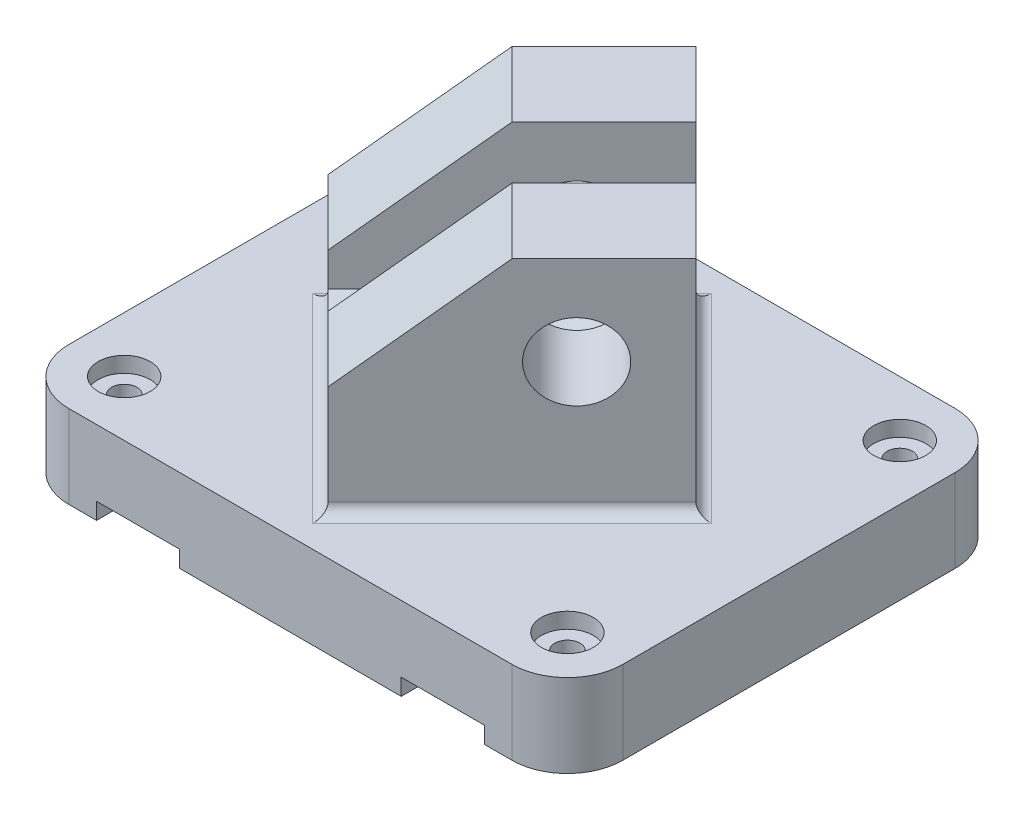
ISO-10303-21;
HEADER;
FILE_DESCRIPTION(('STEP AP214'),'2;1');
FILE_NAME('part.step','',(''),(''),'','','');
FILE_SCHEMA(('AUTOMOTIVE_DESIGN { 1 0 10303 214 1 1 1 1 }'));
ENDSEC;
DATA;
#1=APPLICATION_CONTEXT('core data for automotive mechanical design processes');
#2=APPLICATION_PROTOCOL_DEFINITION('international standard','automotive_design',2000,#1);
#3=PRODUCT_CONTEXT('',#1,'mechanical');
#4=PRODUCT('Part','Part','',(#3));
#5=PRODUCT_RELATED_PRODUCT_CATEGORY('part','',(#4));
#6=PRODUCT_DEFINITION_FORMATION('','',#4);
#7=PRODUCT_DEFINITION_CONTEXT('part definition',#1,'design');
#8=PRODUCT_DEFINITION('design','',#6,#7);
#9=PRODUCT_DEFINITION_SHAPE('','',#8);
#10=(LENGTH_UNIT() NAMED_UNIT(*) SI_UNIT(.MILLI.,.METRE.));
#11=(NAMED_UNIT(*) PLANE_ANGLE_UNIT() SI_UNIT($,.RADIAN.));
#12=(NAMED_UNIT(*) SI_UNIT($,.STERADIAN.) SOLID_ANGLE_UNIT());
#13=UNCERTAINTY_MEASURE_WITH_UNIT(LENGTH_MEASURE(1.E-05),#10,'distance_accuracy_value','');
#14=(GEOMETRIC_REPRESENTATION_CONTEXT(3) GLOBAL_UNCERTAINTY_ASSIGNED_CONTEXT((#13)) GLOBAL_UNIT_ASSIGNED_CONTEXT((#10,
#11,#12)) REPRESENTATION_CONTEXT('',''));
#15=CARTESIAN_POINT('',(0.,0.,0.));
#16=DIRECTION('',(0.,0.,1.));
#17=DIRECTION('',(1.,0.,0.));
#18=AXIS2_PLACEMENT_3D('',#15,#16,#17);
#19=CARTESIAN_POINT('',(-63.5,-9.525,50.8));
#20=DIRECTION('',(0.,1.,0.));
#21=DIRECTION('',(0.,0.,1.));
#22=AXIS2_PLACEMENT_3D('',#19,#20,#21);
#23=PLANE('',#22);
#24=DIRECTION('',(0.,0.,1.));
#25=VECTOR('',#24,1.);
#26=CARTESIAN_POINT('',(-25.4,-9.525,-50.8));
#27=LINE('',#26,#25);
#28=CARTESIAN_POINT('',(-25.4,-9.525,-50.8));
#29=VERTEX_POINT('',#28);
#30=CARTESIAN_POINT('',(-25.4,-9.525,50.8));
#31=VERTEX_POINT('',#30);
#32=EDGE_CURVE('E231',#29,#31,#27,.T.);
#33=ORIENTED_EDGE('',*,*,#32,.F.);
#34=DIRECTION('',(-1.,0.,0.));
#35=VECTOR('',#34,1.);
#36=CARTESIAN_POINT('',(-63.5,-9.525,-50.8));
#37=LINE('',#36,#35);
#38=CARTESIAN_POINT('',(25.4,-9.525,-50.8));
#39=VERTEX_POINT('',#38);
#40=EDGE_CURVE('E381',#39,#29,#37,.T.);
#41=ORIENTED_EDGE('',*,*,#40,.F.);
#42=DIRECTION('',(0.,0.,1.));
#43=VECTOR('',#42,1.);
#44=CARTESIAN_POINT('',(25.4,-9.525,-50.8));
#45=LINE('',#44,#43);
#46=CARTESIAN_POINT('',(25.4,-9.525,50.8));
#47=VERTEX_POINT('',#46);
#48=EDGE_CURVE('E290',#39,#47,#45,.T.);
#49=ORIENTED_EDGE('',*,*,#48,.T.);
#50=DIRECTION('',(1.,0.,0.));
#51=VECTOR('',#50,1.);
#52=CARTESIAN_POINT('',(-63.5,-9.525,50.8));
#53=LINE('',#52,#51);
#54=EDGE_CURVE('E374',#31,#47,#53,.T.);
#55=ORIENTED_EDGE('',*,*,#54,.F.);
#56=EDGE_LOOP('',(#33,#41,#49,#55));
#57=FACE_BOUND('',#56,.T.);
#58=ADVANCED_FACE('F24',(#57),#23,.F.);
#59=CARTESIAN_POINT('',(-50.8,-9.525,-38.1));
#60=DIRECTION('',(0.,1.,0.));
#61=DIRECTION('',(0.,0.,1.));
#62=AXIS2_PLACEMENT_3D('',#59,#60,#61);
#63=CIRCLE('',#62,2.89559999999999);
#64=CARTESIAN_POINT('',(-50.8,-9.525,-35.2044));
#65=VERTEX_POINT('',#64);
#66=EDGE_CURVE('E28',#65,#65,#63,.T.);
#67=ORIENTED_EDGE('',*,*,#66,.T.);
#68=EDGE_LOOP('',(#67));
#69=FACE_BOUND('',#68,.T.);
#70=CARTESIAN_POINT('',(-50.8,-9.525,38.1));
#71=DIRECTION('',(0.,1.,0.));
#72=DIRECTION('',(0.,0.,1.));
#73=AXIS2_PLACEMENT_3D('',#70,#71,#72);
#74=CIRCLE('',#73,2.89559999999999);
#75=CARTESIAN_POINT('',(-50.8,-9.525,40.9956));
#76=VERTEX_POINT('',#75);
#77=EDGE_CURVE('E261',#76,#76,#74,.T.);
#78=ORIENTED_EDGE('',*,*,#77,.T.);
#79=EDGE_LOOP('',(#78));
#80=FACE_BOUND('',#79,.T.);
#81=DIRECTION('',(0.,0.,1.));
#82=VECTOR('',#81,1.);
#83=CARTESIAN_POINT('',(-44.45,-9.525,-50.8));
#84=LINE('',#83,#82);
#85=CARTESIAN_POINT('',(-44.45,-9.525,-50.8));
#86=VERTEX_POINT('',#85);
#87=CARTESIAN_POINT('',(-44.45,-9.525,50.8));
#88=VERTEX_POINT('',#87);
#89=EDGE_CURVE('E249',#86,#88,#84,.T.);
#90=ORIENTED_EDGE('',*,*,#89,.T.);
#91=CARTESIAN_POINT('',(-50.8,-9.525,50.8));
#92=VERTEX_POINT('',#91);
#93=EDGE_CURVE('E371',#92,#88,#53,.T.);
#94=ORIENTED_EDGE('',*,*,#93,.F.);
#95=CARTESIAN_POINT('',(-50.8,-9.525,38.1));
#96=DIRECTION('',(0.,1.,0.));
#97=DIRECTION('',(0.,0.,1.));
#98=AXIS2_PLACEMENT_3D('',#95,#96,#97);
#99=CIRCLE('',#98,12.7);
#100=CARTESIAN_POINT('',(-63.5,-9.525,38.1));
#101=VERTEX_POINT('',#100);
#102=EDGE_CURVE('E33',#92,#101,#99,.F.);
#103=ORIENTED_EDGE('',*,*,#102,.T.);
#104=DIRECTION('',(0.,0.,1.));
#105=VECTOR('',#104,1.);
#106=CARTESIAN_POINT('',(-63.5,-9.525,-50.8));
#107=LINE('',#106,#105);
#108=CARTESIAN_POINT('',(-63.5,-9.525,-38.1));
#109=VERTEX_POINT('',#108);
#110=EDGE_CURVE('E368',#109,#101,#107,.T.);
#111=ORIENTED_EDGE('',*,*,#110,.F.);
#112=CARTESIAN_POINT('',(-50.8,-9.525,-38.1));
#113=DIRECTION('',(0.,1.,0.));
#114=DIRECTION('',(0.,0.,1.));
#115=AXIS2_PLACEMENT_3D('',#112,#113,#114);
#116=CIRCLE('',#115,12.7);
#117=CARTESIAN_POINT('',(-50.8,-9.525,-50.8));
#118=VERTEX_POINT('',#117);
#119=EDGE_CURVE('E11',#109,#118,#116,.F.);
#120=ORIENTED_EDGE('',*,*,#119,.T.);
#121=EDGE_CURVE('E377',#86,#118,#37,.T.);
#122=ORIENTED_EDGE('',*,*,#121,.F.);
#123=EDGE_LOOP('',(#90,#94,#103,#111,#120,#122));
#124=FACE_BOUND('',#123,.T.);
#125=ADVANCED_FACE('F537',(#69,#80,#124),#23,.F.);
#126=CARTESIAN_POINT('',(-63.5,9.525,50.8));
#127=DIRECTION('',(0.,0.,-1.));
#128=DIRECTION('',(-1.,0.,0.));
#129=AXIS2_PLACEMENT_3D('',#126,#127,#128);
#130=PLANE('',#129);
#131=DIRECTION('',(0.,-1.,0.));
#132=VECTOR('',#131,1.);
#133=CARTESIAN_POINT('',(-25.4,-9.525,50.8));
#134=LINE('',#133,#132);
#135=CARTESIAN_POINT('',(-25.4,-5.715,50.8));
#136=VERTEX_POINT('',#135);
#137=EDGE_CURVE('E228',#136,#31,#134,.T.);
#138=ORIENTED_EDGE('',*,*,#137,.T.);
#139=ORIENTED_EDGE('',*,*,#54,.T.);
#140=DIRECTION('',(0.,-1.,0.));
#141=VECTOR('',#140,1.);
#142=CARTESIAN_POINT('',(25.4,-9.525,50.8));
#143=LINE('',#142,#141);
#144=CARTESIAN_POINT('',(25.4,-5.715,50.8));
#145=VERTEX_POINT('',#144);
#146=EDGE_CURVE('E272',#145,#47,#143,.T.);
#147=ORIENTED_EDGE('',*,*,#146,.F.);
#148=DIRECTION('',(-1.,0.,0.));
#149=VECTOR('',#148,1.);
#150=CARTESIAN_POINT('',(25.4,-5.715,50.8));
#151=LINE('',#150,#149);
#152=CARTESIAN_POINT('',(44.45,-5.715,50.8));
#153=VERTEX_POINT('',#152);
#154=EDGE_CURVE('E278',#153,#145,#151,.T.);
#155=ORIENTED_EDGE('',*,*,#154,.F.);
#156=DIRECTION('',(0.,1.,0.));
#157=VECTOR('',#156,1.);
#158=CARTESIAN_POINT('',(44.45,-9.525,50.8));
#159=LINE('',#158,#157);
#160=CARTESIAN_POINT('',(44.45,-9.525,50.8));
#161=VERTEX_POINT('',#160);
#162=EDGE_CURVE('E275',#161,#153,#159,.T.);
#163=ORIENTED_EDGE('',*,*,#162,.F.);
#164=CARTESIAN_POINT('',(50.8,-9.525,50.8));
#165=VERTEX_POINT('',#164);
#166=EDGE_CURVE('E370',#161,#165,#53,.T.);
#167=ORIENTED_EDGE('',*,*,#166,.T.);
#168=DIRECTION('',(0.,-1.,0.));
#169=VECTOR('',#168,1.);
#170=CARTESIAN_POINT('',(50.8,9.525,50.8));
#171=LINE('',#170,#169);
#172=CARTESIAN_POINT('',(50.8,9.525,50.8));
#173=VERTEX_POINT('',#172);
#174=EDGE_CURVE('E452',#165,#173,#171,.F.);
#175=ORIENTED_EDGE('',*,*,#174,.T.);
#176=DIRECTION('',(1.,0.,0.));
#177=VECTOR('',#176,1.);
#178=CARTESIAN_POINT('',(-63.5,9.525,50.8));
#179=LINE('',#178,#177);
#180=CARTESIAN_POINT('',(-50.8,9.525,50.8));
#181=VERTEX_POINT('',#180);
#182=EDGE_CURVE('E384',#181,#173,#179,.T.);
#183=ORIENTED_EDGE('',*,*,#182,.F.);
#184=DIRECTION('',(0.,-1.,0.));
#185=VECTOR('',#184,1.);
#186=CARTESIAN_POINT('',(-50.8,9.525,50.8));
#187=LINE('',#186,#185);
#188=EDGE_CURVE('E449',#181,#92,#187,.T.);
#189=ORIENTED_EDGE('',*,*,#188,.T.);
#190=ORIENTED_EDGE('',*,*,#93,.T.);
#191=DIRECTION('',(0.,1.,0.));
#192=VECTOR('',#191,1.);
#193=CARTESIAN_POINT('',(-44.45,-9.525,50.8));
#194=LINE('',#193,#192);
#195=CARTESIAN_POINT('',(-44.45,-5.715,50.8));
#196=VERTEX_POINT('',#195);
#197=EDGE_CURVE('E238',#88,#196,#194,.T.);
#198=ORIENTED_EDGE('',*,*,#197,.T.);
#199=DIRECTION('',(1.,0.,0.));
#200=VECTOR('',#199,1.);
#201=CARTESIAN_POINT('',(-25.4,-5.715,50.8));
#202=LINE('',#201,#200);
#203=EDGE_CURVE('E219',#196,#136,#202,.T.);
#204=ORIENTED_EDGE('',*,*,#203,.T.);
#205=EDGE_LOOP('',(#138,#139,#147,#155,#163,#167,#175,#183,#189,#190,#198,#204));
#206=FACE_BOUND('',#205,.T.);
#207=ADVANCED_FACE('F236',(#206),#130,.F.);
#208=CARTESIAN_POINT('',(-63.5,9.525,-50.8));
#209=DIRECTION('',(0.,0.,1.));
#210=DIRECTION('',(1.,0.,0.));
#211=AXIS2_PLACEMENT_3D('',#208,#209,#210);
#212=PLANE('',#211);
#213=DIRECTION('',(0.,-1.,0.));
#214=VECTOR('',#213,1.);
#215=CARTESIAN_POINT('',(-25.4,-9.525,-50.8));
#216=LINE('',#215,#214);
#217=CARTESIAN_POINT('',(-25.4,-5.715,-50.8));
#218=VERTEX_POINT('',#217);
#219=EDGE_CURVE('E240',#218,#29,#216,.T.);
#220=ORIENTED_EDGE('',*,*,#219,.F.);
#221=DIRECTION('',(1.,0.,0.));
#222=VECTOR('',#221,1.);
#223=CARTESIAN_POINT('',(-25.4,-5.715,-50.8));
#224=LINE('',#223,#222);
#225=CARTESIAN_POINT('',(-44.45,-5.715,-50.8));
#226=VERTEX_POINT('',#225);
#227=EDGE_CURVE('E222',#226,#218,#224,.T.);
#228=ORIENTED_EDGE('',*,*,#227,.F.);
#229=DIRECTION('',(0.,1.,0.));
#230=VECTOR('',#229,1.);
#231=CARTESIAN_POINT('',(-44.45,-9.525,-50.8));
#232=LINE('',#231,#230);
#233=EDGE_CURVE('E225',#86,#226,#232,.T.);
#234=ORIENTED_EDGE('',*,*,#233,.F.);
#235=ORIENTED_EDGE('',*,*,#121,.T.);
#236=DIRECTION('',(0.,-1.,0.));
#237=VECTOR('',#236,1.);
#238=CARTESIAN_POINT('',(-50.8,9.525,-50.8));
#239=LINE('',#238,#237);
#240=CARTESIAN_POINT('',(-50.8,9.525,-50.8));
#241=VERTEX_POINT('',#240);
#242=EDGE_CURVE('E427',#118,#241,#239,.F.);
#243=ORIENTED_EDGE('',*,*,#242,.T.);
#244=DIRECTION('',(-1.,0.,0.));
#245=VECTOR('',#244,1.);
#246=CARTESIAN_POINT('',(-63.5,9.525,-50.8));
#247=LINE('',#246,#245);
#248=CARTESIAN_POINT('',(50.8,9.525,-50.8));
#249=VERTEX_POINT('',#248);
#250=EDGE_CURVE('E390',#249,#241,#247,.T.);
#251=ORIENTED_EDGE('',*,*,#250,.F.);
#252=DIRECTION('',(0.,-1.,0.));
#253=VECTOR('',#252,1.);
#254=CARTESIAN_POINT('',(50.8,9.525,-50.8));
#255=LINE('',#254,#253);
#256=CARTESIAN_POINT('',(50.8,-9.525,-50.8));
#257=VERTEX_POINT('',#256);
#258=EDGE_CURVE('E429',#249,#257,#255,.T.);
#259=ORIENTED_EDGE('',*,*,#258,.T.);
#260=CARTESIAN_POINT('',(44.45,-9.525,-50.8));
#261=VERTEX_POINT('',#260);
#262=EDGE_CURVE('E378',#257,#261,#37,.T.);
#263=ORIENTED_EDGE('',*,*,#262,.T.);
#264=DIRECTION('',(0.,1.,0.));
#265=VECTOR('',#264,1.);
#266=CARTESIAN_POINT('',(44.45,-9.525,-50.8));
#267=LINE('',#266,#265);
#268=CARTESIAN_POINT('',(44.45,-5.715,-50.8));
#269=VERTEX_POINT('',#268);
#270=EDGE_CURVE('E284',#261,#269,#267,.T.);
#271=ORIENTED_EDGE('',*,*,#270,.T.);
#272=DIRECTION('',(-1.,0.,0.));
#273=VECTOR('',#272,1.);
#274=CARTESIAN_POINT('',(25.4,-5.715,-50.8));
#275=LINE('',#274,#273);
#276=CARTESIAN_POINT('',(25.4,-5.715,-50.8));
#277=VERTEX_POINT('',#276);
#278=EDGE_CURVE('E287',#269,#277,#275,.T.);
#279=ORIENTED_EDGE('',*,*,#278,.T.);
#280=DIRECTION('',(0.,-1.,0.));
#281=VECTOR('',#280,1.);
#282=CARTESIAN_POINT('',(25.4,-9.525,-50.8));
#283=LINE('',#282,#281);
#284=EDGE_CURVE('E281',#277,#39,#283,.T.);
#285=ORIENTED_EDGE('',*,*,#284,.T.);
#286=ORIENTED_EDGE('',*,*,#40,.T.);
#287=EDGE_LOOP('',(#220,#228,#234,#235,#243,#251,#259,#263,#271,#279,#285,#286));
#288=FACE_BOUND('',#287,.T.);
#289=ADVANCED_FACE('F512',(#288),#212,.F.);
#290=CARTESIAN_POINT('',(0.,60.325,42.1368017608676));
#291=DIRECTION('',(0.,1.,0.));
#292=DIRECTION('',(0.,0.,1.));
#293=AXIS2_PLACEMENT_3D('',#290,#291,#292);
#294=PLANE('',#293);
#295=DIRECTION('',(-0.707106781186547,0.,0.707106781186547));
#296=VECTOR('',#295,1.);
#297=CARTESIAN_POINT('',(51.0843088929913,60.325,-63.2156911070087));
#298=LINE('',#297,#296);
#299=CARTESIAN_POINT('',(15.0027097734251,60.325,-27.1340919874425));
#300=VERTEX_POINT('',#299);
#301=CARTESIAN_POINT('',(-6.06569110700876,60.325,-6.06569110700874));
#302=VERTEX_POINT('',#301);
#303=EDGE_CURVE('E324',#300,#302,#298,.T.);
#304=ORIENTED_EDGE('',*,*,#303,.F.);
#305=DIRECTION('',(-0.707106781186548,0.,-0.707106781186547));
#306=VECTOR('',#305,1.);
#307=CARTESIAN_POINT('',(42.1368017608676,60.325,0.));
#308=LINE('',#307,#306);
#309=CARTESIAN_POINT('',(0.,60.325,-42.1368017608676));
#310=VERTEX_POINT('',#309);
#311=EDGE_CURVE('E349',#300,#310,#308,.T.);
#312=ORIENTED_EDGE('',*,*,#311,.T.);
#313=DIRECTION('',(-0.707106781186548,0.,0.707106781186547));
#314=VECTOR('',#313,1.);
#315=CARTESIAN_POINT('',(0.,60.325,-42.1368017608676));
#316=LINE('',#315,#314);
#317=CARTESIAN_POINT('',(-21.0684008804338,60.325,-21.0684008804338));
#318=VERTEX_POINT('',#317);
#319=EDGE_CURVE('E353',#310,#318,#316,.T.);
#320=ORIENTED_EDGE('',*,*,#319,.T.);
#321=DIRECTION('',(0.707106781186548,0.,0.707106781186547));
#322=VECTOR('',#321,1.);
#323=CARTESIAN_POINT('',(21.0684008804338,60.325,21.0684008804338));
#324=LINE('',#323,#322);
#325=EDGE_CURVE('E394',#318,#302,#324,.T.);
#326=ORIENTED_EDGE('',*,*,#325,.T.);
#327=EDGE_LOOP('',(#304,#312,#320,#326));
#328=FACE_BOUND('',#327,.T.);
#329=ADVANCED_FACE('F574',(#328),#294,.T.);
#330=CARTESIAN_POINT('',(190.724327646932,34.925,232.861129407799));
#331=DIRECTION('',(-0.458732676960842,0.761005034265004,0.458732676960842));
#332=DIRECTION('',(0.,-0.516256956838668,0.856433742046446));
#333=AXIS2_PLACEMENT_3D('',#330,#331,#332);
#334=PLANE('',#333);
#335=DIRECTION('',(-0.538111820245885,-0.648745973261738,0.538111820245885));
#336=VECTOR('',#335,1.);
#337=CARTESIAN_POINT('',(-27.1340919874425,34.925,15.002709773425));
#338=LINE('',#337,#336);
#339=CARTESIAN_POINT('',(-27.1340919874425,34.925,15.0027097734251));
#340=VERTEX_POINT('',#339);
#341=EDGE_CURVE('E399',#302,#340,#338,.T.);
#342=ORIENTED_EDGE('',*,*,#341,.F.);
#343=ORIENTED_EDGE('',*,*,#325,.F.);
#344=DIRECTION('',(-0.538111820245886,-0.648745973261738,0.538111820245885));
#345=VECTOR('',#344,1.);
#346=CARTESIAN_POINT('',(-8.86708606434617,75.0348680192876,-33.2697156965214));
#347=LINE('',#346,#345);
#348=CARTESIAN_POINT('',(-42.1368017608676,34.925,0.));
#349=VERTEX_POINT('',#348);
#350=EDGE_CURVE('E341',#318,#349,#347,.T.);
#351=ORIENTED_EDGE('',*,*,#350,.T.);
#352=DIRECTION('',(-0.707106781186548,0.,-0.707106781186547));
#353=VECTOR('',#352,1.);
#354=CARTESIAN_POINT('',(190.724327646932,34.925,232.861129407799));
#355=LINE('',#354,#353);
#356=EDGE_CURVE('E337',#340,#349,#355,.T.);
#357=ORIENTED_EDGE('',*,*,#356,.F.);
#358=EDGE_LOOP('',(#342,#343,#351,#357));
#359=FACE_BOUND('',#358,.T.);
#360=ADVANCED_FACE('F579',(#359),#334,.T.);
#361=CARTESIAN_POINT('',(-42.1368017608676,60.325,0.));
#362=DIRECTION('',(0.707106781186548,0.,-0.707106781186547));
#363=DIRECTION('',(-0.707106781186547,0.,-0.707106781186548));
#364=AXIS2_PLACEMENT_3D('',#361,#362,#363);
#365=PLANE('',#364);
#366=DIRECTION('',(0.,-1.,0.));
#367=VECTOR('',#366,1.);
#368=CARTESIAN_POINT('',(-42.1368017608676,60.325,0.));
#369=LINE('',#368,#367);
#370=CARTESIAN_POINT('',(-42.1368017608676,12.065,0.));
#371=VERTEX_POINT('',#370);
#372=EDGE_CURVE('E356',#349,#371,#369,.T.);
#373=ORIENTED_EDGE('',*,*,#372,.T.);
#374=DIRECTION('',(0.707106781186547,0.,0.707106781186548));
#375=VECTOR('',#374,1.);
#376=CARTESIAN_POINT('',(-42.1368017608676,12.065,0.));
#377=LINE('',#376,#375);
#378=CARTESIAN_POINT('',(0.,12.065,42.1368017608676));
#379=VERTEX_POINT('',#378);
#380=EDGE_CURVE('E423',#371,#379,#377,.T.);
#381=ORIENTED_EDGE('',*,*,#380,.T.);
#382=DIRECTION('',(0.,-1.,0.));
#383=VECTOR('',#382,1.);
#384=CARTESIAN_POINT('',(0.,60.325,42.1368017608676));
#385=LINE('',#384,#383);
#386=CARTESIAN_POINT('',(0.,34.925,42.1368017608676));
#387=VERTEX_POINT('',#386);
#388=EDGE_CURVE('E365',#387,#379,#385,.T.);
#389=ORIENTED_EDGE('',*,*,#388,.F.);
#390=CARTESIAN_POINT('',(-15.0027097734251,34.925,27.1340919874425));
#391=VERTEX_POINT('',#390);
#392=EDGE_CURVE('E338',#387,#391,#355,.T.);
#393=ORIENTED_EDGE('',*,*,#392,.T.);
#394=DIRECTION('',(0.,1.,0.));
#395=VECTOR('',#394,1.);
#396=CARTESIAN_POINT('',(-15.0027097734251,27.1705988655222,27.1340919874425));
#397=LINE('',#396,#395);
#398=CARTESIAN_POINT('',(-15.0027097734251,27.1705988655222,27.1340919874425));
#399=VERTEX_POINT('',#398);
#400=EDGE_CURVE('E315',#399,#391,#397,.T.);
#401=ORIENTED_EDGE('',*,*,#400,.F.);
#402=DIRECTION('',(0.666794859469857,0.332820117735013,0.666794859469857));
#403=VECTOR('',#402,1.);
#404=CARTESIAN_POINT('',(-21.0684008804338,24.1430049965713,21.0684008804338));
#405=LINE('',#404,#403);
#406=CARTESIAN_POINT('',(-21.0684008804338,24.1430049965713,21.0684008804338));
#407=VERTEX_POINT('',#406);
#408=EDGE_CURVE('E312',#407,#399,#405,.T.);
#409=ORIENTED_EDGE('',*,*,#408,.F.);
#410=DIRECTION('',(0.666794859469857,-0.332820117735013,0.666794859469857));
#411=VECTOR('',#410,1.);
#412=CARTESIAN_POINT('',(-21.0684008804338,24.1430049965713,21.0684008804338));
#413=LINE('',#412,#411);
#414=CARTESIAN_POINT('',(-27.1340919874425,27.1705988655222,15.0027097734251));
#415=VERTEX_POINT('',#414);
#416=EDGE_CURVE('E309',#415,#407,#413,.T.);
#417=ORIENTED_EDGE('',*,*,#416,.F.);
#418=DIRECTION('',(0.,-1.,0.));
#419=VECTOR('',#418,1.);
#420=CARTESIAN_POINT('',(-27.1340919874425,27.1705988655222,15.0027097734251));
#421=LINE('',#420,#419);
#422=EDGE_CURVE('E317',#340,#415,#421,.T.);
#423=ORIENTED_EDGE('',*,*,#422,.F.);
#424=ORIENTED_EDGE('',*,*,#356,.T.);
#425=EDGE_LOOP('',(#373,#381,#389,#393,#401,#409,#417,#423,#424));
#426=FACE_BOUND('',#425,.T.);
#427=ADVANCED_FACE('F571',(#426),#365,.F.);
#428=CARTESIAN_POINT('',(0.,60.325,42.1368017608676));
#429=DIRECTION('',(-0.707106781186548,0.,-0.707106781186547));
#430=DIRECTION('',(-0.707106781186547,0.,0.707106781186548));
#431=AXIS2_PLACEMENT_3D('',#428,#429,#430);
#432=PLANE('',#431);
#433=CARTESIAN_POINT('',(28.4760821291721,39.8598907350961,13.6607196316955));
#434=DIRECTION('',(0.707106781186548,0.,0.707106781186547));
#435=DIRECTION('',(0.707106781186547,0.,-0.707106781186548));
#436=AXIS2_PLACEMENT_3D('',#433,#434,#435);
#437=CIRCLE('',#436,8.773948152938);
#438=CARTESIAN_POINT('',(34.6802003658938,39.8598907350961,7.45660139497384));
#439=VERTEX_POINT('',#438);
#440=EDGE_CURVE('E293',#439,#439,#437,.T.);
#441=ORIENTED_EDGE('',*,*,#440,.F.);
#442=EDGE_LOOP('',(#441));
#443=FACE_BOUND('',#442,.T.);
#444=ORIENTED_EDGE('',*,*,#388,.T.);
#445=DIRECTION('',(0.707106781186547,0.,-0.707106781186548));
#446=VECTOR('',#445,1.);
#447=CARTESIAN_POINT('',(0.,12.065,42.1368017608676));
#448=LINE('',#447,#446);
#449=CARTESIAN_POINT('',(42.1368017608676,12.065,0.));
#450=VERTEX_POINT('',#449);
#451=EDGE_CURVE('E425',#379,#450,#448,.T.);
#452=ORIENTED_EDGE('',*,*,#451,.T.);
#453=DIRECTION('',(0.,-1.,0.));
#454=VECTOR('',#453,1.);
#455=CARTESIAN_POINT('',(42.1368017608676,60.325,0.));
#456=LINE('',#455,#454);
#457=CARTESIAN_POINT('',(42.1368017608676,60.325,0.));
#458=VERTEX_POINT('',#457);
#459=EDGE_CURVE('E362',#458,#450,#456,.T.);
#460=ORIENTED_EDGE('',*,*,#459,.F.);
#461=DIRECTION('',(0.707106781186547,0.,-0.707106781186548));
#462=VECTOR('',#461,1.);
#463=CARTESIAN_POINT('',(0.,60.325,42.1368017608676));
#464=LINE('',#463,#462);
#465=CARTESIAN_POINT('',(21.0684008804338,60.325,21.0684008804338));
#466=VERTEX_POINT('',#465);
#467=EDGE_CURVE('E347',#466,#458,#464,.T.);
#468=ORIENTED_EDGE('',*,*,#467,.F.);
#469=DIRECTION('',(0.538111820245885,0.648745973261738,-0.538111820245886));
#470=VECTOR('',#469,1.);
#471=CARTESIAN_POINT('',(8.86708606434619,45.6151319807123,33.2697156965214));
#472=LINE('',#471,#470);
#473=EDGE_CURVE('E344',#387,#466,#472,.T.);
#474=ORIENTED_EDGE('',*,*,#473,.F.);
#475=EDGE_LOOP('',(#444,#452,#460,#468,#474));
#476=FACE_BOUND('',#475,.T.);
#477=ADVANCED_FACE('F759',(#443,#476),#432,.F.);
#478=CARTESIAN_POINT('',(0.,60.325,-42.1368017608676));
#479=DIRECTION('',(0.707106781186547,0.,0.707106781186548));
#480=DIRECTION('',(0.707106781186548,0.,-0.707106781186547));
#481=AXIS2_PLACEMENT_3D('',#478,#479,#480);
#482=PLANE('',#481);
#483=CARTESIAN_POINT('',(-13.6607196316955,39.8598907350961,-28.4760821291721));
#484=DIRECTION('',(0.707106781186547,0.,0.707106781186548));
#485=DIRECTION('',(0.707106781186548,0.,-0.707106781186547));
#486=AXIS2_PLACEMENT_3D('',#483,#484,#485);
#487=CIRCLE('',#486,8.773948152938);
#488=CARTESIAN_POINT('',(-7.45660139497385,39.8598907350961,-34.6802003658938));
#489=VERTEX_POINT('',#488);
#490=EDGE_CURVE('E306',#489,#489,#487,.T.);
#491=ORIENTED_EDGE('',*,*,#490,.T.);
#492=EDGE_LOOP('',(#491));
#493=FACE_BOUND('',#492,.T.);
#494=DIRECTION('',(0.,-1.,0.));
#495=VECTOR('',#494,1.);
#496=CARTESIAN_POINT('',(0.,60.325,-42.1368017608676));
#497=LINE('',#496,#495);
#498=CARTESIAN_POINT('',(0.,12.065,-42.1368017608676));
#499=VERTEX_POINT('',#498);
#500=EDGE_CURVE('E359',#310,#499,#497,.T.);
#501=ORIENTED_EDGE('',*,*,#500,.T.);
#502=DIRECTION('',(-0.707106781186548,0.,0.707106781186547));
#503=VECTOR('',#502,1.);
#504=CARTESIAN_POINT('',(0.,12.065,-42.1368017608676));
#505=LINE('',#504,#503);
#506=EDGE_CURVE('E407',#499,#371,#505,.T.);
#507=ORIENTED_EDGE('',*,*,#506,.T.);
#508=ORIENTED_EDGE('',*,*,#372,.F.);
#509=ORIENTED_EDGE('',*,*,#350,.F.);
#510=ORIENTED_EDGE('',*,*,#319,.F.);
#511=EDGE_LOOP('',(#501,#507,#508,#509,#510));
#512=FACE_BOUND('',#511,.T.);
#513=ADVANCED_FACE('F755',(#493,#512),#482,.F.);
#514=DIRECTION('',(-0.707106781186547,0.,0.707106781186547));
#515=VECTOR('',#514,1.);
#516=CARTESIAN_POINT('',(63.2156911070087,60.325,-51.0843088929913));
#517=LINE('',#516,#515);
#518=CARTESIAN_POINT('',(27.1340919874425,60.325,-15.0027097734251));
#519=VERTEX_POINT('',#518);
#520=CARTESIAN_POINT('',(6.0656911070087,60.325,6.06569110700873));
#521=VERTEX_POINT('',#520);
#522=EDGE_CURVE('E326',#519,#521,#517,.T.);
#523=ORIENTED_EDGE('',*,*,#522,.T.);
#524=EDGE_CURVE('E393',#521,#466,#324,.T.);
#525=ORIENTED_EDGE('',*,*,#524,.T.);
#526=ORIENTED_EDGE('',*,*,#467,.T.);
#527=EDGE_CURVE('E350',#458,#519,#308,.T.);
#528=ORIENTED_EDGE('',*,*,#527,.T.);
#529=EDGE_LOOP('',(#523,#525,#526,#528));
#530=FACE_BOUND('',#529,.T.);
#531=ADVANCED_FACE('F492',(#530),#294,.T.);
#532=CARTESIAN_POINT('',(-63.5,9.525,50.8));
#533=DIRECTION('',(0.,1.,0.));
#534=DIRECTION('',(0.,0.,1.));
#535=AXIS2_PLACEMENT_3D('',#532,#533,#534);
#536=PLANE('',#535);
#537=CARTESIAN_POINT('',(-50.8,9.525,-38.1));
#538=DIRECTION('',(0.,1.,0.));
#539=DIRECTION('',(0.,0.,1.));
#540=AXIS2_PLACEMENT_3D('',#537,#538,#539);
#541=CIRCLE('',#540,5.95376);
#542=CARTESIAN_POINT('',(-50.8,9.525,-32.14624));
#543=VERTEX_POINT('',#542);
#544=EDGE_CURVE('E950',#543,#543,#541,.T.);
#545=ORIENTED_EDGE('',*,*,#544,.F.);
#546=EDGE_LOOP('',(#545));
#547=FACE_BOUND('',#546,.T.);
#548=CARTESIAN_POINT('',(50.8,9.525,-38.1));
#549=DIRECTION('',(0.,1.,0.));
#550=DIRECTION('',(0.,0.,1.));
#551=AXIS2_PLACEMENT_3D('',#548,#549,#550);
#552=CIRCLE('',#551,5.95376);
#553=CARTESIAN_POINT('',(50.8,9.525,-32.14624));
#554=VERTEX_POINT('',#553);
#555=EDGE_CURVE('E467',#554,#554,#552,.T.);
#556=ORIENTED_EDGE('',*,*,#555,.F.);
#557=EDGE_LOOP('',(#556));
#558=FACE_BOUND('',#557,.T.);
#559=CARTESIAN_POINT('',(50.8,9.525,38.1));
#560=DIRECTION('',(0.,1.,0.));
#561=DIRECTION('',(0.,0.,1.));
#562=AXIS2_PLACEMENT_3D('',#559,#560,#561);
#563=CIRCLE('',#562,5.95376);
#564=CARTESIAN_POINT('',(50.8,9.525,44.05376));
#565=VERTEX_POINT('',#564);
#566=EDGE_CURVE('E463',#565,#565,#563,.T.);
#567=ORIENTED_EDGE('',*,*,#566,.F.);
#568=EDGE_LOOP('',(#567));
#569=FACE_BOUND('',#568,.T.);
#570=CARTESIAN_POINT('',(-50.8,9.525,38.1));
#571=DIRECTION('',(0.,1.,0.));
#572=DIRECTION('',(0.,0.,1.));
#573=AXIS2_PLACEMENT_3D('',#570,#571,#572);
#574=CIRCLE('',#573,5.95376);
#575=CARTESIAN_POINT('',(-50.8,9.525,44.05376));
#576=VERTEX_POINT('',#575);
#577=EDGE_CURVE('E258',#576,#576,#574,.T.);
#578=ORIENTED_EDGE('',*,*,#577,.F.);
#579=EDGE_LOOP('',(#578));
#580=FACE_BOUND('',#579,.T.);
#581=DIRECTION('',(0.707106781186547,0.,0.707106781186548));
#582=VECTOR('',#581,1.);
#583=CARTESIAN_POINT('',(-29.2144521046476,9.525,16.5144521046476));
#584=LINE('',#583,#582);
#585=CARTESIAN_POINT('',(0.,9.525,45.7289042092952));
#586=VERTEX_POINT('',#585);
#587=CARTESIAN_POINT('',(-45.7289042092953,9.525,0.));
#588=VERTEX_POINT('',#587);
#589=EDGE_CURVE('E414',#586,#588,#584,.F.);
#590=ORIENTED_EDGE('',*,*,#589,.T.);
#591=DIRECTION('',(-0.707106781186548,0.,0.707106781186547));
#592=VECTOR('',#591,1.);
#593=CARTESIAN_POINT('',(-80.0144521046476,9.525,34.2855478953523));
#594=LINE('',#593,#592);
#595=CARTESIAN_POINT('',(0.,9.525,-45.7289042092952));
#596=VERTEX_POINT('',#595);
#597=EDGE_CURVE('E418',#588,#596,#594,.F.);
#598=ORIENTED_EDGE('',*,*,#597,.T.);
#599=DIRECTION('',(-0.707106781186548,0.,-0.707106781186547));
#600=VECTOR('',#599,1.);
#601=CARTESIAN_POINT('',(16.5144521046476,9.525,-29.2144521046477));
#602=LINE('',#601,#600);
#603=CARTESIAN_POINT('',(45.7289042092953,9.525,0.));
#604=VERTEX_POINT('',#603);
#605=EDGE_CURVE('E416',#596,#604,#602,.F.);
#606=ORIENTED_EDGE('',*,*,#605,.T.);
#607=DIRECTION('',(0.707106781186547,0.,-0.707106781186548));
#608=VECTOR('',#607,1.);
#609=CARTESIAN_POINT('',(-34.2855478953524,9.525,80.0144521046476));
#610=LINE('',#609,#608);
#611=EDGE_CURVE('E412',#604,#586,#610,.F.);
#612=ORIENTED_EDGE('',*,*,#611,.T.);
#613=EDGE_LOOP('',(#590,#598,#606,#612));
#614=FACE_BOUND('',#613,.T.);
#615=DIRECTION('',(0.,0.,-1.));
#616=VECTOR('',#615,1.);
#617=CARTESIAN_POINT('',(63.5,9.525,-50.8));
#618=LINE('',#617,#616);
#619=CARTESIAN_POINT('',(63.5,9.525,38.1));
#620=VERTEX_POINT('',#619);
#621=CARTESIAN_POINT('',(63.5,9.525,-38.1));
#622=VERTEX_POINT('',#621);
#623=EDGE_CURVE('E387',#620,#622,#618,.T.);
#624=ORIENTED_EDGE('',*,*,#623,.T.);
#625=CARTESIAN_POINT('',(50.8,9.525,-38.1));
#626=DIRECTION('',(0.,1.,0.));
#627=DIRECTION('',(0.,0.,1.));
#628=AXIS2_PLACEMENT_3D('',#625,#626,#627);
#629=CIRCLE('',#628,12.7);
#630=EDGE_CURVE('E447',#622,#249,#629,.T.);
#631=ORIENTED_EDGE('',*,*,#630,.T.);
#632=ORIENTED_EDGE('',*,*,#250,.T.);
#633=CARTESIAN_POINT('',(-50.8,9.525,-38.1));
#634=DIRECTION('',(0.,1.,0.));
#635=DIRECTION('',(0.,0.,1.));
#636=AXIS2_PLACEMENT_3D('',#633,#634,#635);
#637=CIRCLE('',#636,12.7);
#638=CARTESIAN_POINT('',(-63.5,9.525,-38.1));
#639=VERTEX_POINT('',#638);
#640=EDGE_CURVE('E443',#241,#639,#637,.T.);
#641=ORIENTED_EDGE('',*,*,#640,.T.);
#642=DIRECTION('',(0.,0.,1.));
#643=VECTOR('',#642,1.);
#644=CARTESIAN_POINT('',(-63.5,9.525,-50.8));
#645=LINE('',#644,#643);
#646=CARTESIAN_POINT('',(-63.5,9.525,38.1));
#647=VERTEX_POINT('',#646);
#648=EDGE_CURVE('E380',#639,#647,#645,.T.);
#649=ORIENTED_EDGE('',*,*,#648,.T.);
#650=CARTESIAN_POINT('',(-50.8,9.525,38.1));
#651=DIRECTION('',(0.,1.,0.));
#652=DIRECTION('',(0.,0.,1.));
#653=AXIS2_PLACEMENT_3D('',#650,#651,#652);
#654=CIRCLE('',#653,12.7);
#655=EDGE_CURVE('E441',#647,#181,#654,.T.);
#656=ORIENTED_EDGE('',*,*,#655,.T.);
#657=ORIENTED_EDGE('',*,*,#182,.T.);
#658=CARTESIAN_POINT('',(50.8,9.525,38.1));
#659=DIRECTION('',(0.,1.,0.));
#660=DIRECTION('',(0.,0.,1.));
#661=AXIS2_PLACEMENT_3D('',#658,#659,#660);
#662=CIRCLE('',#661,12.7);
#663=EDGE_CURVE('E445',#173,#620,#662,.T.);
#664=ORIENTED_EDGE('',*,*,#663,.T.);
#665=EDGE_LOOP('',(#624,#631,#632,#641,#649,#656,#657,#664));
#666=FACE_BOUND('',#665,.T.);
#667=ADVANCED_FACE('F489',(#547,#558,#569,#580,#614,#666),#536,.T.);
#668=CARTESIAN_POINT('',(-63.5,9.525,-50.8));
#669=DIRECTION('',(1.,0.,0.));
#670=DIRECTION('',(0.,0.,-1.));
#671=AXIS2_PLACEMENT_3D('',#668,#669,#670);
#672=PLANE('',#671);
#673=ORIENTED_EDGE('',*,*,#648,.F.);
#674=DIRECTION('',(0.,-1.,0.));
#675=VECTOR('',#674,1.);
#676=CARTESIAN_POINT('',(-63.5,9.525,-38.1));
#677=LINE('',#676,#675);
#678=EDGE_CURVE('E456',#639,#109,#677,.T.);
#679=ORIENTED_EDGE('',*,*,#678,.T.);
#680=ORIENTED_EDGE('',*,*,#110,.T.);
#681=DIRECTION('',(0.,-1.,0.));
#682=VECTOR('',#681,1.);
#683=CARTESIAN_POINT('',(-63.5,9.525,38.1));
#684=LINE('',#683,#682);
#685=EDGE_CURVE('E454',#101,#647,#684,.F.);
#686=ORIENTED_EDGE('',*,*,#685,.T.);
#687=EDGE_LOOP('',(#673,#679,#680,#686));
#688=FACE_BOUND('',#687,.T.);
#689=ADVANCED_FACE('F26',(#688),#672,.F.);
#690=CARTESIAN_POINT('',(63.5,9.525,-50.8));
#691=DIRECTION('',(-1.,0.,0.));
#692=DIRECTION('',(0.,0.,1.));
#693=AXIS2_PLACEMENT_3D('',#690,#691,#692);
#694=PLANE('',#693);
#695=DIRECTION('',(0.,0.,-1.));
#696=VECTOR('',#695,1.);
#697=CARTESIAN_POINT('',(63.5,-9.525,-50.8));
#698=LINE('',#697,#696);
#699=CARTESIAN_POINT('',(63.5,-9.525,38.1));
#700=VERTEX_POINT('',#699);
#701=CARTESIAN_POINT('',(63.5,-9.525,-38.1));
#702=VERTEX_POINT('',#701);
#703=EDGE_CURVE('E373',#700,#702,#698,.T.);
#704=ORIENTED_EDGE('',*,*,#703,.T.);
#705=DIRECTION('',(0.,-1.,0.));
#706=VECTOR('',#705,1.);
#707=CARTESIAN_POINT('',(63.5,9.525,-38.1));
#708=LINE('',#707,#706);
#709=EDGE_CURVE('E439',#702,#622,#708,.F.);
#710=ORIENTED_EDGE('',*,*,#709,.T.);
#711=ORIENTED_EDGE('',*,*,#623,.F.);
#712=DIRECTION('',(0.,-1.,0.));
#713=VECTOR('',#712,1.);
#714=CARTESIAN_POINT('',(63.5,9.525,38.1));
#715=LINE('',#714,#713);
#716=EDGE_CURVE('E436',#620,#700,#715,.T.);
#717=ORIENTED_EDGE('',*,*,#716,.T.);
#718=EDGE_LOOP('',(#704,#710,#711,#717));
#719=FACE_BOUND('',#718,.T.);
#720=ADVANCED_FACE('F552',(#719),#694,.F.);
#721=CARTESIAN_POINT('',(50.8,-9.525,-38.1));
#722=DIRECTION('',(0.,1.,0.));
#723=DIRECTION('',(0.,0.,1.));
#724=AXIS2_PLACEMENT_3D('',#721,#722,#723);
#725=CIRCLE('',#724,2.89559999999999);
#726=CARTESIAN_POINT('',(50.8,-9.525,-35.2044));
#727=VERTEX_POINT('',#726);
#728=EDGE_CURVE('E464',#727,#727,#725,.T.);
#729=ORIENTED_EDGE('',*,*,#728,.T.);
#730=EDGE_LOOP('',(#729));
#731=FACE_BOUND('',#730,.T.);
#732=CARTESIAN_POINT('',(50.8,-9.525,38.1));
#733=DIRECTION('',(0.,1.,0.));
#734=DIRECTION('',(0.,0.,1.));
#735=AXIS2_PLACEMENT_3D('',#732,#733,#734);
#736=CIRCLE('',#735,2.89559999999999);
#737=CARTESIAN_POINT('',(50.8,-9.525,40.9956));
#738=VERTEX_POINT('',#737);
#739=EDGE_CURVE('E234',#738,#738,#736,.T.);
#740=ORIENTED_EDGE('',*,*,#739,.T.);
#741=EDGE_LOOP('',(#740));
#742=FACE_BOUND('',#741,.T.);
#743=ORIENTED_EDGE('',*,*,#262,.F.);
#744=CARTESIAN_POINT('',(50.8,-9.525,-38.1));
#745=DIRECTION('',(0.,1.,0.));
#746=DIRECTION('',(0.,0.,1.));
#747=AXIS2_PLACEMENT_3D('',#744,#745,#746);
#748=CIRCLE('',#747,12.7);
#749=EDGE_CURVE('E434',#257,#702,#748,.F.);
#750=ORIENTED_EDGE('',*,*,#749,.T.);
#751=ORIENTED_EDGE('',*,*,#703,.F.);
#752=CARTESIAN_POINT('',(50.8,-9.525,38.1));
#753=DIRECTION('',(0.,1.,0.));
#754=DIRECTION('',(0.,0.,1.));
#755=AXIS2_PLACEMENT_3D('',#752,#753,#754);
#756=CIRCLE('',#755,12.7);
#757=EDGE_CURVE('E432',#700,#165,#756,.F.);
#758=ORIENTED_EDGE('',*,*,#757,.T.);
#759=ORIENTED_EDGE('',*,*,#166,.F.);
#760=DIRECTION('',(0.,0.,1.));
#761=VECTOR('',#760,1.);
#762=CARTESIAN_POINT('',(44.45,-9.525,-50.8));
#763=LINE('',#762,#761);
#764=EDGE_CURVE('E296',#261,#161,#763,.T.);
#765=ORIENTED_EDGE('',*,*,#764,.F.);
#766=EDGE_LOOP('',(#743,#750,#751,#758,#759,#765));
#767=FACE_BOUND('',#766,.T.);
#768=ADVANCED_FACE('F516',(#731,#742,#767),#23,.F.);
#769=CARTESIAN_POINT('',(42.1368017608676,60.325,0.));
#770=DIRECTION('',(-0.707106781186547,0.,0.707106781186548));
#771=DIRECTION('',(0.707106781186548,0.,0.707106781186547));
#772=AXIS2_PLACEMENT_3D('',#769,#770,#771);
#773=PLANE('',#772);
#774=ORIENTED_EDGE('',*,*,#459,.T.);
#775=DIRECTION('',(-0.707106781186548,0.,-0.707106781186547));
#776=VECTOR('',#775,1.);
#777=CARTESIAN_POINT('',(42.1368017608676,12.065,0.));
#778=LINE('',#777,#776);
#779=EDGE_CURVE('E421',#450,#499,#778,.T.);
#780=ORIENTED_EDGE('',*,*,#779,.T.);
#781=ORIENTED_EDGE('',*,*,#500,.F.);
#782=ORIENTED_EDGE('',*,*,#311,.F.);
#783=DIRECTION('',(0.,-1.,0.));
#784=VECTOR('',#783,1.);
#785=CARTESIAN_POINT('',(15.0027097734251,60.325,-27.1340919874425));
#786=LINE('',#785,#784);
#787=CARTESIAN_POINT('',(15.0027097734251,27.1705988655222,-27.1340919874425));
#788=VERTEX_POINT('',#787);
#789=EDGE_CURVE('E334',#300,#788,#786,.T.);
#790=ORIENTED_EDGE('',*,*,#789,.T.);
#791=DIRECTION('',(0.666794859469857,-0.332820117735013,0.666794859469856));
#792=VECTOR('',#791,1.);
#793=CARTESIAN_POINT('',(31.7734636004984,18.7997420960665,-10.3633381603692));
#794=LINE('',#793,#792);
#795=CARTESIAN_POINT('',(21.0684008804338,24.1430049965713,-21.0684008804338));
#796=VERTEX_POINT('',#795);
#797=EDGE_CURVE('E404',#788,#796,#794,.T.);
#798=ORIENTED_EDGE('',*,*,#797,.T.);
#799=DIRECTION('',(0.666794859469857,0.332820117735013,0.666794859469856));
#800=VECTOR('',#799,1.);
#801=CARTESIAN_POINT('',(47.8326788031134,37.5019714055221,5.69587704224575));
#802=LINE('',#801,#800);
#803=CARTESIAN_POINT('',(27.1340919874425,27.1705988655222,-15.0027097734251));
#804=VERTEX_POINT('',#803);
#805=EDGE_CURVE('E401',#796,#804,#802,.T.);
#806=ORIENTED_EDGE('',*,*,#805,.T.);
#807=DIRECTION('',(0.,1.,0.));
#808=VECTOR('',#807,1.);
#809=CARTESIAN_POINT('',(27.1340919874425,60.325,-15.0027097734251));
#810=LINE('',#809,#808);
#811=EDGE_CURVE('E323',#804,#519,#810,.T.);
#812=ORIENTED_EDGE('',*,*,#811,.T.);
#813=ORIENTED_EDGE('',*,*,#527,.F.);
#814=EDGE_LOOP('',(#774,#780,#781,#782,#790,#798,#806,#812,#813));
#815=FACE_BOUND('',#814,.T.);
#816=ADVANCED_FACE('F560',(#815),#773,.F.);
#817=DIRECTION('',(0.538111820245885,0.648745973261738,-0.538111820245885));
#818=VECTOR('',#817,1.);
#819=CARTESIAN_POINT('',(-15.0027097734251,34.925,27.1340919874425));
#820=LINE('',#819,#818);
#821=EDGE_CURVE('E397',#391,#521,#820,.T.);
#822=ORIENTED_EDGE('',*,*,#821,.F.);
#823=ORIENTED_EDGE('',*,*,#392,.F.);
#824=ORIENTED_EDGE('',*,*,#473,.T.);
#825=ORIENTED_EDGE('',*,*,#524,.F.);
#826=EDGE_LOOP('',(#822,#823,#824,#825));
#827=FACE_BOUND('',#826,.T.);
#828=ADVANCED_FACE('F749',(#827),#334,.T.);
#829=CARTESIAN_POINT('',(57.15,24.1430049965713,-57.15));
#830=DIRECTION('',(-0.235339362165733,-0.942990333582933,-0.235339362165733));
#831=DIRECTION('',(0.,0.242140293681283,-0.970241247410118));
#832=AXIS2_PLACEMENT_3D('',#829,#830,#831);
#833=PLANE('',#832);
#834=DIRECTION('',(-0.707106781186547,0.,0.707106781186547));
#835=VECTOR('',#834,1.);
#836=CARTESIAN_POINT('',(51.0843088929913,27.1705988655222,-63.2156911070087));
#837=LINE('',#836,#835);
#838=EDGE_CURVE('E321',#788,#415,#837,.T.);
#839=ORIENTED_EDGE('',*,*,#838,.T.);
#840=ORIENTED_EDGE('',*,*,#416,.T.);
#841=DIRECTION('',(-0.707106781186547,0.,0.707106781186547));
#842=VECTOR('',#841,1.);
#843=CARTESIAN_POINT('',(57.15,24.1430049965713,-57.15));
#844=LINE('',#843,#842);
#845=EDGE_CURVE('E320',#796,#407,#844,.T.);
#846=ORIENTED_EDGE('',*,*,#845,.F.);
#847=ORIENTED_EDGE('',*,*,#797,.F.);
#848=EDGE_LOOP('',(#839,#840,#846,#847));
#849=FACE_BOUND('',#848,.T.);
#850=ADVANCED_FACE('F745',(#849),#833,.F.);
#851=CARTESIAN_POINT('',(57.15,24.1430049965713,-57.15));
#852=DIRECTION('',(0.235339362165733,-0.942990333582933,0.235339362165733));
#853=DIRECTION('',(0.,-0.242140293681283,-0.970241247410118));
#854=AXIS2_PLACEMENT_3D('',#851,#852,#853);
#855=PLANE('',#854);
#856=ORIENTED_EDGE('',*,*,#845,.T.);
#857=ORIENTED_EDGE('',*,*,#408,.T.);
#858=DIRECTION('',(-0.707106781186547,0.,0.707106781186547));
#859=VECTOR('',#858,1.);
#860=CARTESIAN_POINT('',(63.2156911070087,27.1705988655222,-51.0843088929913));
#861=LINE('',#860,#859);
#862=EDGE_CURVE('E329',#804,#399,#861,.T.);
#863=ORIENTED_EDGE('',*,*,#862,.F.);
#864=ORIENTED_EDGE('',*,*,#805,.F.);
#865=EDGE_LOOP('',(#856,#857,#863,#864));
#866=FACE_BOUND('',#865,.T.);
#867=ADVANCED_FACE('F738',(#866),#855,.F.);
#868=CARTESIAN_POINT('',(51.0843088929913,27.1705988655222,-63.2156911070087));
#869=DIRECTION('',(-0.707106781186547,0.,-0.707106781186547));
#870=DIRECTION('',(-0.707106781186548,0.,0.707106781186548));
#871=AXIS2_PLACEMENT_3D('',#868,#869,#870);
#872=PLANE('',#871);
#873=CARTESIAN_POINT('',(1.34199014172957,39.8598907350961,-13.473372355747));
#874=DIRECTION('',(-0.707106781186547,0.,-0.707106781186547));
#875=DIRECTION('',(-0.707106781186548,0.,0.707106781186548));
#876=AXIS2_PLACEMENT_3D('',#873,#874,#875);
#877=CIRCLE('',#876,8.773948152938);
#878=CARTESIAN_POINT('',(7.54610837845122,39.8598907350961,-19.6774905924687));
#879=VERTEX_POINT('',#878);
#880=EDGE_CURVE('E303',#879,#879,#877,.T.);
#881=ORIENTED_EDGE('',*,*,#880,.T.);
#882=EDGE_LOOP('',(#881));
#883=FACE_BOUND('',#882,.T.);
#884=ORIENTED_EDGE('',*,*,#303,.T.);
#885=ORIENTED_EDGE('',*,*,#341,.T.);
#886=ORIENTED_EDGE('',*,*,#422,.T.);
#887=ORIENTED_EDGE('',*,*,#838,.F.);
#888=ORIENTED_EDGE('',*,*,#789,.F.);
#889=EDGE_LOOP('',(#884,#885,#886,#887,#888));
#890=FACE_BOUND('',#889,.T.);
#891=ADVANCED_FACE('F734',(#883,#890),#872,.F.);
#892=CARTESIAN_POINT('',(63.2156911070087,27.1705988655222,-51.0843088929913));
#893=DIRECTION('',(0.707106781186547,0.,0.707106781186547));
#894=DIRECTION('',(0.707106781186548,0.,-0.707106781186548));
#895=AXIS2_PLACEMENT_3D('',#892,#893,#894);
#896=PLANE('',#895);
#897=CARTESIAN_POINT('',(13.473372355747,39.8598907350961,-1.34199014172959));
#898=DIRECTION('',(0.707106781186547,0.,0.707106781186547));
#899=DIRECTION('',(0.707106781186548,0.,-0.707106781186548));
#900=AXIS2_PLACEMENT_3D('',#897,#898,#899);
#901=CIRCLE('',#900,8.773948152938);
#902=CARTESIAN_POINT('',(19.6774905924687,39.8598907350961,-7.54610837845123));
#903=VERTEX_POINT('',#902);
#904=EDGE_CURVE('E302',#903,#903,#901,.T.);
#905=ORIENTED_EDGE('',*,*,#904,.T.);
#906=EDGE_LOOP('',(#905));
#907=FACE_BOUND('',#906,.T.);
#908=ORIENTED_EDGE('',*,*,#862,.T.);
#909=ORIENTED_EDGE('',*,*,#400,.T.);
#910=ORIENTED_EDGE('',*,*,#821,.T.);
#911=ORIENTED_EDGE('',*,*,#522,.F.);
#912=ORIENTED_EDGE('',*,*,#811,.F.);
#913=EDGE_LOOP('',(#908,#909,#910,#911,#912));
#914=FACE_BOUND('',#913,.T.);
#915=ADVANCED_FACE('F737',(#907,#914),#896,.F.);
#916=CARTESIAN_POINT('',(-49.7423187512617,39.8598907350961,-64.5576812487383));
#917=DIRECTION('',(0.707106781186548,0.,0.707106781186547));
#918=DIRECTION('',(0.707106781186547,0.,-0.707106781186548));
#919=AXIS2_PLACEMENT_3D('',#916,#917,#918);
#920=CYLINDRICAL_SURFACE('',#919,8.773948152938);
#921=ORIENTED_EDGE('',*,*,#440,.T.);
#922=EDGE_LOOP('',(#921));
#923=FACE_BOUND('',#922,.T.);
#924=ORIENTED_EDGE('',*,*,#904,.F.);
#925=EDGE_LOOP('',(#924));
#926=FACE_BOUND('',#925,.T.);
#927=ADVANCED_FACE('F732',(#923,#926),#920,.F.);
#928=CARTESIAN_POINT('',(7.54610837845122,39.8598907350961,-19.6774905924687));
#929=CARTESIAN_POINT('',(7.38983015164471,39.8598907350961,-19.8337688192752));
#930=CARTESIAN_POINT('',(7.23355192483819,39.8598907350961,-19.9900470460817));
#931=CARTESIAN_POINT('',(6.92099547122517,39.8598907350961,-20.3026034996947));
#932=CARTESIAN_POINT('',(6.76471724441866,39.8598907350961,-20.4588817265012));
#933=CARTESIAN_POINT('',(6.45216079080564,39.8598907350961,-20.7714381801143));
#934=CARTESIAN_POINT('',(6.29588256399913,39.8598907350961,-20.9277164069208));
#935=CARTESIAN_POINT('',(5.9833261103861,39.8598907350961,-21.2402728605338));
#936=CARTESIAN_POINT('',(5.8270478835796,39.8598907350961,-21.3965510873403));
#937=CARTESIAN_POINT('',(5.51449142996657,39.8598907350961,-21.7091075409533));
#938=CARTESIAN_POINT('',(5.35821320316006,39.8598907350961,-21.8653857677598));
#939=CARTESIAN_POINT('',(5.04565674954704,39.8598907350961,-22.1779422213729));
#940=CARTESIAN_POINT('',(4.88937852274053,39.8598907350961,-22.3342204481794));
#941=CARTESIAN_POINT('',(4.57682206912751,39.8598907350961,-22.6467769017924));
#942=CARTESIAN_POINT('',(4.42054384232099,39.8598907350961,-22.8030551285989));
#943=CARTESIAN_POINT('',(4.10798738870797,39.8598907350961,-23.1156115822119));
#944=CARTESIAN_POINT('',(3.95170916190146,39.8598907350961,-23.2718898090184));
#945=CARTESIAN_POINT('',(3.63915270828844,39.8598907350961,-23.5844462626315));
#946=CARTESIAN_POINT('',(3.48287448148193,39.8598907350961,-23.740724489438));
#947=CARTESIAN_POINT('',(3.1703180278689,39.8598907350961,-24.053280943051));
#948=CARTESIAN_POINT('',(3.0140398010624,39.8598907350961,-24.2095591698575));
#949=CARTESIAN_POINT('',(2.70148334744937,39.8598907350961,-24.5221156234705));
#950=CARTESIAN_POINT('',(2.54520512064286,39.8598907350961,-24.678393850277));
#951=CARTESIAN_POINT('',(2.23264866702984,39.8598907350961,-24.9909503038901));
#952=CARTESIAN_POINT('',(2.07637044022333,39.8598907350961,-25.1472285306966));
#953=CARTESIAN_POINT('',(1.76381398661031,39.8598907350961,-25.4597849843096));
#954=CARTESIAN_POINT('',(1.60753575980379,39.8598907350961,-25.6160632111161));
#955=CARTESIAN_POINT('',(1.29497930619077,39.8598907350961,-25.9286196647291));
#956=CARTESIAN_POINT('',(1.13870107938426,39.8598907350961,-26.0848978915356));
#957=CARTESIAN_POINT('',(0.826144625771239,39.8598907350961,-26.3974543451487));
#958=CARTESIAN_POINT('',(0.66986639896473,39.8598907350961,-26.5537325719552));
#959=CARTESIAN_POINT('',(0.357309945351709,39.8598907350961,-26.8662890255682));
#960=CARTESIAN_POINT('',(0.201031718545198,39.8598907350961,-27.0225672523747));
#961=CARTESIAN_POINT('',(-0.111524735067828,39.8598907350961,-27.3351237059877));
#962=CARTESIAN_POINT('',(-0.267802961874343,39.8598907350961,-27.4914019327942));
#963=CARTESIAN_POINT('',(-0.580359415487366,39.8598907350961,-27.8039583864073));
#964=CARTESIAN_POINT('',(-0.736637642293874,39.8598907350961,-27.9602366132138));
#965=CARTESIAN_POINT('',(-1.04919409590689,39.8598907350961,-28.2727930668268));
#966=CARTESIAN_POINT('',(-1.20547232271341,39.8598907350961,-28.4290712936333));
#967=CARTESIAN_POINT('',(-1.51802877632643,39.8598907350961,-28.7416277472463));
#968=CARTESIAN_POINT('',(-1.67430700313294,39.8598907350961,-28.8979059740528));
#969=CARTESIAN_POINT('',(-1.98686345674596,39.8598907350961,-29.2104624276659));
#970=CARTESIAN_POINT('',(-2.14314168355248,39.8598907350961,-29.3667406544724));
#971=CARTESIAN_POINT('',(-2.4556981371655,39.8598907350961,-29.6792971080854));
#972=CARTESIAN_POINT('',(-2.611976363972,39.8598907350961,-29.8355753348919));
#973=CARTESIAN_POINT('',(-2.92453281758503,39.8598907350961,-30.1481317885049));
#974=CARTESIAN_POINT('',(-3.08081104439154,39.8598907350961,-30.3044100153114));
#975=CARTESIAN_POINT('',(-3.39336749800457,39.8598907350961,-30.6169664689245));
#976=CARTESIAN_POINT('',(-3.54964572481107,39.8598907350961,-30.773244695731));
#977=CARTESIAN_POINT('',(-3.86220217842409,39.8598907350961,-31.085801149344));
#978=CARTESIAN_POINT('',(-4.01848040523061,39.8598907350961,-31.2420793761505));
#979=CARTESIAN_POINT('',(-4.33103685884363,39.8598907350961,-31.5546358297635));
#980=CARTESIAN_POINT('',(-4.48731508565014,39.8598907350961,-31.71091405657));
#981=CARTESIAN_POINT('',(-4.79987153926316,39.8598907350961,-32.0234705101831));
#982=CARTESIAN_POINT('',(-4.95614976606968,39.8598907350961,-32.1797487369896));
#983=CARTESIAN_POINT('',(-5.2687062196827,39.8598907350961,-32.4923051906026));
#984=CARTESIAN_POINT('',(-5.4249844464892,39.8598907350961,-32.6485834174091));
#985=CARTESIAN_POINT('',(-5.73754090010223,39.8598907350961,-32.9611398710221));
#986=CARTESIAN_POINT('',(-5.89381912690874,39.8598907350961,-33.1174180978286));
#987=CARTESIAN_POINT('',(-6.20637558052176,39.8598907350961,-33.4299745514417));
#988=CARTESIAN_POINT('',(-6.36265380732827,39.8598907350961,-33.5862527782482));
#989=CARTESIAN_POINT('',(-6.67521026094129,39.8598907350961,-33.8988092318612));
#990=CARTESIAN_POINT('',(-6.83148848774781,39.8598907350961,-34.0550874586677));
#991=CARTESIAN_POINT('',(-7.14404494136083,39.8598907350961,-34.3676439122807));
#992=CARTESIAN_POINT('',(-7.30032316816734,39.8598907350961,-34.5239221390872));
#993=CARTESIAN_POINT('',(-7.45660139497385,39.8598907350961,-34.6802003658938));
#994=B_SPLINE_CURVE_WITH_KNOTS('',3,(#928,#929,#930,#931,#932,#933,#934,#935,#936,#937,#938,
#939,#940,#941,#942,#943,#944,#945,#946,#947,#948,#949,#950,#951,#952,#953,#954,#955,#956,#957,
#958,#959,#960,#961,#962,#963,#964,#965,#966,#967,#968,#969,#970,#971,#972,#973,#974,#975,#976,
#977,#978,#979,#980,#981,#982,#983,#984,#985,#986,#987,#988,#989,#990,#991,#992,#993),
.UNSPECIFIED.,.F.,.F.,(4,2,2,2,2,2,2,2,2,2,2,2,2,2,2,2,2,2,2,2,2,2,2,2,2,2,2,2,2,2,2,2,4),(0.,
0.663032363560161,1.32606472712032,1.98909709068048,2.65212945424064,3.3151618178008,
3.97819418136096,4.64122654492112,5.30425890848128,5.96729127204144,6.63032363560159,
7.29335599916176,7.95638836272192,8.61942072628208,9.28245308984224,9.94548545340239,
10.6085178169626,11.2715501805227,11.9345825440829,12.597614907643,13.2606472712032,
13.9236796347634,14.5867119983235,15.2497443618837,15.9127767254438,16.575809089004,
17.2388414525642,17.9018738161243,18.5649061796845,19.2279385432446,19.8909709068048,
20.554003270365,21.2170356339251),.UNSPECIFIED.);
#995=EDGE_CURVE('BSEAM729',#879,#489,#994,.T.);
#996=ORIENTED_EDGE('',*,*,#880,.F.);
#997=ORIENTED_EDGE('',*,*,#490,.F.);
#998=ORIENTED_EDGE('',*,*,#995,.T.);
#999=ORIENTED_EDGE('',*,*,#995,.F.);
#1000=EDGE_LOOP('',(#996,#998,#997,#999));
#1001=FACE_BOUND('',#1000,.T.);
#1002=ADVANCED_FACE('F729',(#1001),#920,.F.);
#1003=CARTESIAN_POINT('',(25.4,-9.525,-50.8));
#1004=DIRECTION('',(-1.,0.,0.));
#1005=DIRECTION('',(0.,-1.,0.));
#1006=AXIS2_PLACEMENT_3D('',#1003,#1004,#1005);
#1007=PLANE('',#1006);
#1008=ORIENTED_EDGE('',*,*,#146,.T.);
#1009=ORIENTED_EDGE('',*,*,#48,.F.);
#1010=ORIENTED_EDGE('',*,*,#284,.F.);
#1011=DIRECTION('',(0.,0.,1.));
#1012=VECTOR('',#1011,1.);
#1013=CARTESIAN_POINT('',(25.4,-5.715,-50.8));
#1014=LINE('',#1013,#1012);
#1015=EDGE_CURVE('E291',#277,#145,#1014,.T.);
#1016=ORIENTED_EDGE('',*,*,#1015,.T.);
#1017=EDGE_LOOP('',(#1008,#1009,#1010,#1016));
#1018=FACE_BOUND('',#1017,.T.);
#1019=ADVANCED_FACE('F724',(#1018),#1007,.F.);
#1020=CARTESIAN_POINT('',(25.4,-5.715,-50.8));
#1021=DIRECTION('',(0.,1.,0.));
#1022=DIRECTION('',(0.,0.,1.));
#1023=AXIS2_PLACEMENT_3D('',#1020,#1021,#1022);
#1024=PLANE('',#1023);
#1025=ORIENTED_EDGE('',*,*,#154,.T.);
#1026=ORIENTED_EDGE('',*,*,#1015,.F.);
#1027=ORIENTED_EDGE('',*,*,#278,.F.);
#1028=DIRECTION('',(0.,0.,1.));
#1029=VECTOR('',#1028,1.);
#1030=CARTESIAN_POINT('',(44.45,-5.715,-50.8));
#1031=LINE('',#1030,#1029);
#1032=EDGE_CURVE('E294',#269,#153,#1031,.T.);
#1033=ORIENTED_EDGE('',*,*,#1032,.T.);
#1034=EDGE_LOOP('',(#1025,#1026,#1027,#1033));
#1035=FACE_BOUND('',#1034,.T.);
#1036=ADVANCED_FACE('F527',(#1035),#1024,.F.);
#1037=CARTESIAN_POINT('',(44.45,-9.525,-50.8));
#1038=DIRECTION('',(1.,0.,0.));
#1039=DIRECTION('',(0.,0.,-1.));
#1040=AXIS2_PLACEMENT_3D('',#1037,#1038,#1039);
#1041=PLANE('',#1040);
#1042=ORIENTED_EDGE('',*,*,#162,.T.);
#1043=ORIENTED_EDGE('',*,*,#1032,.F.);
#1044=ORIENTED_EDGE('',*,*,#270,.F.);
#1045=ORIENTED_EDGE('',*,*,#764,.T.);
#1046=EDGE_LOOP('',(#1042,#1043,#1044,#1045));
#1047=FACE_BOUND('',#1046,.T.);
#1048=ADVANCED_FACE('F522',(#1047),#1041,.F.);
#1049=CARTESIAN_POINT('',(1.79605122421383,12.065,43.9328529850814));
#1050=DIRECTION('',(0.707106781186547,0.,-0.707106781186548));
#1051=DIRECTION('',(-0.707106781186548,0.,-0.707106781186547));
#1052=AXIS2_PLACEMENT_3D('',#1049,#1050,#1051);
#1053=CYLINDRICAL_SURFACE('',#1052,2.54);
#1054=CARTESIAN_POINT('',(0.,12.065,45.7289042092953));
#1055=DIRECTION('',(1.,0.,0.));
#1056=DIRECTION('',(0.,0.,-1.));
#1057=AXIS2_PLACEMENT_3D('',#1054,#1055,#1056);
#1058=ELLIPSE('',#1057,3.59210244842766,2.54);
#1059=EDGE_CURVE('E266',#586,#379,#1058,.T.);
#1060=ORIENTED_EDGE('',*,*,#1059,.F.);
#1061=ORIENTED_EDGE('',*,*,#611,.F.);
#1062=CARTESIAN_POINT('',(45.7289042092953,12.065,0.));
#1063=DIRECTION('',(0.,0.,-1.));
#1064=DIRECTION('',(1.,0.,0.));
#1065=AXIS2_PLACEMENT_3D('',#1062,#1063,#1064);
#1066=ELLIPSE('',#1065,3.59210244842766,2.54);
#1067=EDGE_CURVE('E269',#450,#604,#1066,.F.);
#1068=ORIENTED_EDGE('',*,*,#1067,.F.);
#1069=ORIENTED_EDGE('',*,*,#451,.F.);
#1070=EDGE_LOOP('',(#1060,#1061,#1068,#1069));
#1071=FACE_BOUND('',#1070,.T.);
#1072=ADVANCED_FACE('F717',(#1071),#1053,.F.);
#1073=CARTESIAN_POINT('',(43.9328529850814,12.065,-1.79605122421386));
#1074=DIRECTION('',(-0.707106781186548,0.,-0.707106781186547));
#1075=DIRECTION('',(-0.707106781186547,0.,0.707106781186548));
#1076=AXIS2_PLACEMENT_3D('',#1073,#1074,#1075);
#1077=CYLINDRICAL_SURFACE('',#1076,2.54);
#1078=ORIENTED_EDGE('',*,*,#1067,.T.);
#1079=ORIENTED_EDGE('',*,*,#605,.F.);
#1080=CARTESIAN_POINT('',(0.,12.065,-45.7289042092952));
#1081=DIRECTION('',(-1.,0.,0.));
#1082=DIRECTION('',(0.,0.,-1.));
#1083=AXIS2_PLACEMENT_3D('',#1080,#1081,#1082);
#1084=ELLIPSE('',#1083,3.59210244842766,2.54);
#1085=EDGE_CURVE('E264',#499,#596,#1084,.F.);
#1086=ORIENTED_EDGE('',*,*,#1085,.F.);
#1087=ORIENTED_EDGE('',*,*,#779,.F.);
#1088=EDGE_LOOP('',(#1078,#1079,#1086,#1087));
#1089=FACE_BOUND('',#1088,.T.);
#1090=ADVANCED_FACE('F713',(#1089),#1077,.F.);
#1091=CARTESIAN_POINT('',(-43.9328529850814,12.065,1.7960512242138));
#1092=DIRECTION('',(0.707106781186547,0.,0.707106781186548));
#1093=DIRECTION('',(0.707106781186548,0.,-0.707106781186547));
#1094=AXIS2_PLACEMENT_3D('',#1091,#1092,#1093);
#1095=CYLINDRICAL_SURFACE('',#1094,2.54);
#1096=ORIENTED_EDGE('',*,*,#1059,.T.);
#1097=ORIENTED_EDGE('',*,*,#380,.F.);
#1098=CARTESIAN_POINT('',(-45.7289042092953,12.065,0.));
#1099=DIRECTION('',(0.,0.,1.));
#1100=DIRECTION('',(1.,0.,0.));
#1101=AXIS2_PLACEMENT_3D('',#1098,#1099,#1100);
#1102=ELLIPSE('',#1101,3.59210244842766,2.54);
#1103=EDGE_CURVE('E262',#588,#371,#1102,.T.);
#1104=ORIENTED_EDGE('',*,*,#1103,.F.);
#1105=ORIENTED_EDGE('',*,*,#589,.F.);
#1106=EDGE_LOOP('',(#1096,#1097,#1104,#1105));
#1107=FACE_BOUND('',#1106,.T.);
#1108=ADVANCED_FACE('F709',(#1107),#1095,.F.);
#1109=CARTESIAN_POINT('',(-1.79605122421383,12.065,-43.9328529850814));
#1110=DIRECTION('',(-0.707106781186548,0.,0.707106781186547));
#1111=DIRECTION('',(0.707106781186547,0.,0.707106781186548));
#1112=AXIS2_PLACEMENT_3D('',#1109,#1110,#1111);
#1113=CYLINDRICAL_SURFACE('',#1112,2.54);
#1114=ORIENTED_EDGE('',*,*,#1085,.T.);
#1115=ORIENTED_EDGE('',*,*,#597,.F.);
#1116=ORIENTED_EDGE('',*,*,#1103,.T.);
#1117=ORIENTED_EDGE('',*,*,#506,.F.);
#1118=EDGE_LOOP('',(#1114,#1115,#1116,#1117));
#1119=FACE_BOUND('',#1118,.T.);
#1120=ADVANCED_FACE('F706',(#1119),#1113,.F.);
#1121=CARTESIAN_POINT('',(50.8,9.525,-38.1));
#1122=DIRECTION('',(0.,-1.,0.));
#1123=DIRECTION('',(0.,0.,-1.));
#1124=AXIS2_PLACEMENT_3D('',#1121,#1122,#1123);
#1125=CYLINDRICAL_SURFACE('',#1124,12.7);
#1126=ORIENTED_EDGE('',*,*,#630,.F.);
#1127=ORIENTED_EDGE('',*,*,#709,.F.);
#1128=ORIENTED_EDGE('',*,*,#749,.F.);
#1129=ORIENTED_EDGE('',*,*,#258,.F.);
#1130=EDGE_LOOP('',(#1126,#1127,#1128,#1129));
#1131=FACE_BOUND('',#1130,.T.);
#1132=ADVANCED_FACE('F509',(#1131),#1125,.T.);
#1133=CARTESIAN_POINT('',(50.8,9.525,38.1));
#1134=DIRECTION('',(0.,-1.,0.));
#1135=DIRECTION('',(0.,0.,-1.));
#1136=AXIS2_PLACEMENT_3D('',#1133,#1134,#1135);
#1137=CYLINDRICAL_SURFACE('',#1136,12.7);
#1138=ORIENTED_EDGE('',*,*,#663,.F.);
#1139=ORIENTED_EDGE('',*,*,#174,.F.);
#1140=ORIENTED_EDGE('',*,*,#757,.F.);
#1141=ORIENTED_EDGE('',*,*,#716,.F.);
#1142=EDGE_LOOP('',(#1138,#1139,#1140,#1141));
#1143=FACE_BOUND('',#1142,.T.);
#1144=ADVANCED_FACE('F551',(#1143),#1137,.T.);
#1145=CARTESIAN_POINT('',(-50.8,9.525,-38.1));
#1146=DIRECTION('',(0.,-1.,0.));
#1147=DIRECTION('',(0.,0.,-1.));
#1148=AXIS2_PLACEMENT_3D('',#1145,#1146,#1147);
#1149=CYLINDRICAL_SURFACE('',#1148,12.7);
#1150=ORIENTED_EDGE('',*,*,#640,.F.);
#1151=ORIENTED_EDGE('',*,*,#242,.F.);
#1152=ORIENTED_EDGE('',*,*,#119,.F.);
#1153=ORIENTED_EDGE('',*,*,#678,.F.);
#1154=EDGE_LOOP('',(#1150,#1151,#1152,#1153));
#1155=FACE_BOUND('',#1154,.T.);
#1156=ADVANCED_FACE('F541',(#1155),#1149,.T.);
#1157=CARTESIAN_POINT('',(-50.8,9.525,38.1));
#1158=DIRECTION('',(0.,-1.,0.));
#1159=DIRECTION('',(0.,0.,-1.));
#1160=AXIS2_PLACEMENT_3D('',#1157,#1158,#1159);
#1161=CYLINDRICAL_SURFACE('',#1160,12.7);
#1162=ORIENTED_EDGE('',*,*,#655,.F.);
#1163=ORIENTED_EDGE('',*,*,#685,.F.);
#1164=ORIENTED_EDGE('',*,*,#102,.F.);
#1165=ORIENTED_EDGE('',*,*,#188,.F.);
#1166=EDGE_LOOP('',(#1162,#1163,#1164,#1165));
#1167=FACE_BOUND('',#1166,.T.);
#1168=ADVANCED_FACE('F547',(#1167),#1161,.T.);
#1169=CARTESIAN_POINT('',(-50.8,9.525,38.1));
#1170=DIRECTION('',(0.,1.,0.));
#1171=DIRECTION('',(0.,0.,1.));
#1172=AXIS2_PLACEMENT_3D('',#1169,#1170,#1171);
#1173=CYLINDRICAL_SURFACE('',#1172,2.89559999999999);
#1174=CARTESIAN_POINT('',(-50.8,5.9436,38.1));
#1175=DIRECTION('',(0.,1.,0.));
#1176=DIRECTION('',(0.,0.,1.));
#1177=AXIS2_PLACEMENT_3D('',#1174,#1175,#1176);
#1178=CIRCLE('',#1177,2.8956);
#1179=CARTESIAN_POINT('',(-50.8,5.9436,40.9956));
#1180=VERTEX_POINT('',#1179);
#1181=EDGE_CURVE('E248',#1180,#1180,#1178,.T.);
#1182=ORIENTED_EDGE('',*,*,#1181,.T.);
#1183=EDGE_LOOP('',(#1182));
#1184=FACE_BOUND('',#1183,.T.);
#1185=ORIENTED_EDGE('',*,*,#77,.F.);
#1186=EDGE_LOOP('',(#1185));
#1187=FACE_BOUND('',#1186,.T.);
#1188=ADVANCED_FACE('F689',(#1184,#1187),#1173,.F.);
#1189=CARTESIAN_POINT('',(-50.8,9.525,38.1));
#1190=DIRECTION('',(0.,1.,0.));
#1191=DIRECTION('',(0.,0.,1.));
#1192=AXIS2_PLACEMENT_3D('',#1189,#1190,#1191);
#1193=CYLINDRICAL_SURFACE('',#1192,5.95376);
#1194=CARTESIAN_POINT('',(-50.8,5.9436,38.1));
#1195=DIRECTION('',(0.,1.,0.));
#1196=DIRECTION('',(0.,0.,1.));
#1197=AXIS2_PLACEMENT_3D('',#1194,#1195,#1196);
#1198=CIRCLE('',#1197,5.95376);
#1199=CARTESIAN_POINT('',(-50.8,5.9436,44.05376));
#1200=VERTEX_POINT('',#1199);
#1201=EDGE_CURVE('E255',#1200,#1200,#1198,.T.);
#1202=ORIENTED_EDGE('',*,*,#1201,.F.);
#1203=EDGE_LOOP('',(#1202));
#1204=FACE_BOUND('',#1203,.T.);
#1205=ORIENTED_EDGE('',*,*,#577,.T.);
#1206=EDGE_LOOP('',(#1205));
#1207=FACE_BOUND('',#1206,.T.);
#1208=ADVANCED_FACE('F692',(#1204,#1207),#1193,.F.);
#1209=CARTESIAN_POINT('',(-47.9044,5.9436,38.1));
#1210=DIRECTION('',(0.,-1.,0.));
#1211=DIRECTION('',(0.,0.,-1.));
#1212=AXIS2_PLACEMENT_3D('',#1209,#1210,#1211);
#1213=PLANE('',#1212);
#1214=ORIENTED_EDGE('',*,*,#1181,.F.);
#1215=EDGE_LOOP('',(#1214));
#1216=FACE_BOUND('',#1215,.T.);
#1217=ORIENTED_EDGE('',*,*,#1201,.T.);
#1218=EDGE_LOOP('',(#1217));
#1219=FACE_BOUND('',#1218,.T.);
#1220=ADVANCED_FACE('F601',(#1216,#1219),#1213,.F.);
#1221=CARTESIAN_POINT('',(-25.4,-9.525,-50.8));
#1222=DIRECTION('',(-1.,0.,0.));
#1223=DIRECTION('',(0.,-1.,0.));
#1224=AXIS2_PLACEMENT_3D('',#1221,#1222,#1223);
#1225=PLANE('',#1224);
#1226=ORIENTED_EDGE('',*,*,#137,.F.);
#1227=DIRECTION('',(0.,0.,1.));
#1228=VECTOR('',#1227,1.);
#1229=CARTESIAN_POINT('',(-25.4,-5.715,-50.8));
#1230=LINE('',#1229,#1228);
#1231=EDGE_CURVE('E215',#218,#136,#1230,.T.);
#1232=ORIENTED_EDGE('',*,*,#1231,.F.);
#1233=ORIENTED_EDGE('',*,*,#219,.T.);
#1234=ORIENTED_EDGE('',*,*,#32,.T.);
#1235=EDGE_LOOP('',(#1226,#1232,#1233,#1234));
#1236=FACE_BOUND('',#1235,.T.);
#1237=ADVANCED_FACE('F229',(#1236),#1225,.T.);
#1238=CARTESIAN_POINT('',(-44.45,-9.525,-50.8));
#1239=DIRECTION('',(1.,0.,0.));
#1240=DIRECTION('',(0.,0.,-1.));
#1241=AXIS2_PLACEMENT_3D('',#1238,#1239,#1240);
#1242=PLANE('',#1241);
#1243=ORIENTED_EDGE('',*,*,#197,.F.);
#1244=ORIENTED_EDGE('',*,*,#89,.F.);
#1245=ORIENTED_EDGE('',*,*,#233,.T.);
#1246=DIRECTION('',(0.,0.,1.));
#1247=VECTOR('',#1246,1.);
#1248=CARTESIAN_POINT('',(-44.45,-5.715,-50.8));
#1249=LINE('',#1248,#1247);
#1250=EDGE_CURVE('E41',#226,#196,#1249,.T.);
#1251=ORIENTED_EDGE('',*,*,#1250,.T.);
#1252=EDGE_LOOP('',(#1243,#1244,#1245,#1251));
#1253=FACE_BOUND('',#1252,.T.);
#1254=ADVANCED_FACE('F600',(#1253),#1242,.T.);
#1255=CARTESIAN_POINT('',(-25.4,-5.715,-50.8));
#1256=DIRECTION('',(0.,-1.,0.));
#1257=DIRECTION('',(0.,0.,-1.));
#1258=AXIS2_PLACEMENT_3D('',#1255,#1256,#1257);
#1259=PLANE('',#1258);
#1260=ORIENTED_EDGE('',*,*,#203,.F.);
#1261=ORIENTED_EDGE('',*,*,#1250,.F.);
#1262=ORIENTED_EDGE('',*,*,#227,.T.);
#1263=ORIENTED_EDGE('',*,*,#1231,.T.);
#1264=EDGE_LOOP('',(#1260,#1261,#1262,#1263));
#1265=FACE_BOUND('',#1264,.T.);
#1266=ADVANCED_FACE('F217',(#1265),#1259,.T.);
#1267=CARTESIAN_POINT('',(50.8,9.525,38.1));
#1268=DIRECTION('',(0.,1.,0.));
#1269=DIRECTION('',(0.,0.,1.));
#1270=AXIS2_PLACEMENT_3D('',#1267,#1268,#1269);
#1271=CYLINDRICAL_SURFACE('',#1270,2.89559999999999);
#1272=CARTESIAN_POINT('',(50.8,5.9436,38.1));
#1273=DIRECTION('',(0.,1.,0.));
#1274=DIRECTION('',(0.,0.,1.));
#1275=AXIS2_PLACEMENT_3D('',#1272,#1273,#1274);
#1276=CIRCLE('',#1275,2.8956);
#1277=CARTESIAN_POINT('',(50.8,5.9436,40.9956));
#1278=VERTEX_POINT('',#1277);
#1279=EDGE_CURVE('E466',#1278,#1278,#1276,.T.);
#1280=ORIENTED_EDGE('',*,*,#1279,.T.);
#1281=EDGE_LOOP('',(#1280));
#1282=FACE_BOUND('',#1281,.T.);
#1283=ORIENTED_EDGE('',*,*,#739,.F.);
#1284=EDGE_LOOP('',(#1283));
#1285=FACE_BOUND('',#1284,.T.);
#1286=ADVANCED_FACE('F615',(#1282,#1285),#1271,.F.);
#1287=CARTESIAN_POINT('',(50.8,9.525,38.1));
#1288=DIRECTION('',(0.,1.,0.));
#1289=DIRECTION('',(0.,0.,1.));
#1290=AXIS2_PLACEMENT_3D('',#1287,#1288,#1289);
#1291=CYLINDRICAL_SURFACE('',#1290,5.95376);
#1292=CARTESIAN_POINT('',(50.8,5.9436,38.1));
#1293=DIRECTION('',(0.,1.,0.));
#1294=DIRECTION('',(0.,0.,1.));
#1295=AXIS2_PLACEMENT_3D('',#1292,#1293,#1294);
#1296=CIRCLE('',#1295,5.95376);
#1297=CARTESIAN_POINT('',(50.8,5.9436,44.05376));
#1298=VERTEX_POINT('',#1297);
#1299=EDGE_CURVE('E471',#1298,#1298,#1296,.T.);
#1300=ORIENTED_EDGE('',*,*,#1299,.F.);
#1301=EDGE_LOOP('',(#1300));
#1302=FACE_BOUND('',#1301,.T.);
#1303=ORIENTED_EDGE('',*,*,#566,.T.);
#1304=EDGE_LOOP('',(#1303));
#1305=FACE_BOUND('',#1304,.T.);
#1306=ADVANCED_FACE('F487',(#1302,#1305),#1291,.F.);
#1307=CARTESIAN_POINT('',(53.6956,5.9436,38.1));
#1308=DIRECTION('',(0.,-1.,0.));
#1309=DIRECTION('',(0.,0.,-1.));
#1310=AXIS2_PLACEMENT_3D('',#1307,#1308,#1309);
#1311=PLANE('',#1310);
#1312=ORIENTED_EDGE('',*,*,#1279,.F.);
#1313=EDGE_LOOP('',(#1312));
#1314=FACE_BOUND('',#1313,.T.);
#1315=ORIENTED_EDGE('',*,*,#1299,.T.);
#1316=EDGE_LOOP('',(#1315));
#1317=FACE_BOUND('',#1316,.T.);
#1318=ADVANCED_FACE('F629',(#1314,#1317),#1311,.F.);
#1319=CARTESIAN_POINT('',(50.8,9.525,-38.1));
#1320=DIRECTION('',(0.,1.,0.));
#1321=DIRECTION('',(0.,0.,1.));
#1322=AXIS2_PLACEMENT_3D('',#1319,#1320,#1321);
#1323=CYLINDRICAL_SURFACE('',#1322,2.89559999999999);
#1324=CARTESIAN_POINT('',(50.8,5.9436,-38.1));
#1325=DIRECTION('',(0.,1.,0.));
#1326=DIRECTION('',(0.,0.,1.));
#1327=AXIS2_PLACEMENT_3D('',#1324,#1325,#1326);
#1328=CIRCLE('',#1327,2.8956);
#1329=CARTESIAN_POINT('',(50.8,5.9436,-35.2044));
#1330=VERTEX_POINT('',#1329);
#1331=EDGE_CURVE('E479',#1330,#1330,#1328,.T.);
#1332=ORIENTED_EDGE('',*,*,#1331,.T.);
#1333=EDGE_LOOP('',(#1332));
#1334=FACE_BOUND('',#1333,.T.);
#1335=ORIENTED_EDGE('',*,*,#728,.F.);
#1336=EDGE_LOOP('',(#1335));
#1337=FACE_BOUND('',#1336,.T.);
#1338=ADVANCED_FACE('F636',(#1334,#1337),#1323,.F.);
#1339=CARTESIAN_POINT('',(50.8,9.525,-38.1));
#1340=DIRECTION('',(0.,1.,0.));
#1341=DIRECTION('',(0.,0.,1.));
#1342=AXIS2_PLACEMENT_3D('',#1339,#1340,#1341);
#1343=CYLINDRICAL_SURFACE('',#1342,5.95376);
#1344=CARTESIAN_POINT('',(50.8,5.9436,-38.1));
#1345=DIRECTION('',(0.,1.,0.));
#1346=DIRECTION('',(0.,0.,1.));
#1347=AXIS2_PLACEMENT_3D('',#1344,#1345,#1346);
#1348=CIRCLE('',#1347,5.95376);
#1349=CARTESIAN_POINT('',(50.8,5.9436,-32.14624));
#1350=VERTEX_POINT('',#1349);
#1351=EDGE_CURVE('E474',#1350,#1350,#1348,.T.);
#1352=ORIENTED_EDGE('',*,*,#1351,.F.);
#1353=EDGE_LOOP('',(#1352));
#1354=FACE_BOUND('',#1353,.T.);
#1355=ORIENTED_EDGE('',*,*,#555,.T.);
#1356=EDGE_LOOP('',(#1355));
#1357=FACE_BOUND('',#1356,.T.);
#1358=ADVANCED_FACE('F644',(#1354,#1357),#1343,.F.);
#1359=CARTESIAN_POINT('',(53.6956,5.9436,-38.1));
#1360=DIRECTION('',(0.,-1.,0.));
#1361=DIRECTION('',(0.,0.,-1.));
#1362=AXIS2_PLACEMENT_3D('',#1359,#1360,#1361);
#1363=PLANE('',#1362);
#1364=ORIENTED_EDGE('',*,*,#1331,.F.);
#1365=EDGE_LOOP('',(#1364));
#1366=FACE_BOUND('',#1365,.T.);
#1367=ORIENTED_EDGE('',*,*,#1351,.T.);
#1368=EDGE_LOOP('',(#1367));
#1369=FACE_BOUND('',#1368,.T.);
#1370=ADVANCED_FACE('F652',(#1366,#1369),#1363,.F.);
#1371=CARTESIAN_POINT('',(-50.8,9.525,-38.1));
#1372=DIRECTION('',(0.,1.,0.));
#1373=DIRECTION('',(0.,0.,1.));
#1374=AXIS2_PLACEMENT_3D('',#1371,#1372,#1373);
#1375=CYLINDRICAL_SURFACE('',#1374,2.89559999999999);
#1376=CARTESIAN_POINT('',(-50.8,5.9436,-38.1));
#1377=DIRECTION('',(0.,1.,0.));
#1378=DIRECTION('',(0.,0.,1.));
#1379=AXIS2_PLACEMENT_3D('',#1376,#1377,#1378);
#1380=CIRCLE('',#1379,2.8956);
#1381=CARTESIAN_POINT('',(-50.8,5.9436,-35.2044));
#1382=VERTEX_POINT('',#1381);
#1383=EDGE_CURVE('E946',#1382,#1382,#1380,.T.);
#1384=ORIENTED_EDGE('',*,*,#1383,.T.);
#1385=EDGE_LOOP('',(#1384));
#1386=FACE_BOUND('',#1385,.T.);
#1387=ORIENTED_EDGE('',*,*,#66,.F.);
#1388=EDGE_LOOP('',(#1387));
#1389=FACE_BOUND('',#1388,.T.);
#1390=ADVANCED_FACE('F660',(#1386,#1389),#1375,.F.);
#1391=CARTESIAN_POINT('',(-50.8,9.525,-38.1));
#1392=DIRECTION('',(0.,1.,0.));
#1393=DIRECTION('',(0.,0.,1.));
#1394=AXIS2_PLACEMENT_3D('',#1391,#1392,#1393);
#1395=CYLINDRICAL_SURFACE('',#1394,5.95376);
#1396=CARTESIAN_POINT('',(-50.8,5.9436,-38.1));
#1397=DIRECTION('',(0.,1.,0.));
#1398=DIRECTION('',(0.,0.,1.));
#1399=AXIS2_PLACEMENT_3D('',#1396,#1397,#1398);
#1400=CIRCLE('',#1399,5.95376);
#1401=CARTESIAN_POINT('',(-50.8,5.9436,-32.14624));
#1402=VERTEX_POINT('',#1401);
#1403=EDGE_CURVE('E949',#1402,#1402,#1400,.T.);
#1404=ORIENTED_EDGE('',*,*,#1403,.F.);
#1405=EDGE_LOOP('',(#1404));
#1406=FACE_BOUND('',#1405,.T.);
#1407=ORIENTED_EDGE('',*,*,#544,.T.);
#1408=EDGE_LOOP('',(#1407));
#1409=FACE_BOUND('',#1408,.T.);
#1410=ADVANCED_FACE('F668',(#1406,#1409),#1395,.F.);
#1411=CARTESIAN_POINT('',(-47.9044,5.9436,-38.1));
#1412=DIRECTION('',(0.,-1.,0.));
#1413=DIRECTION('',(0.,0.,-1.));
#1414=AXIS2_PLACEMENT_3D('',#1411,#1412,#1413);
#1415=PLANE('',#1414);
#1416=ORIENTED_EDGE('',*,*,#1383,.F.);
#1417=EDGE_LOOP('',(#1416));
#1418=FACE_BOUND('',#1417,.T.);
#1419=ORIENTED_EDGE('',*,*,#1403,.T.);
#1420=EDGE_LOOP('',(#1419));
#1421=FACE_BOUND('',#1420,.T.);
#1422=ADVANCED_FACE('F676',(#1418,#1421),#1415,.F.);
#1423=CLOSED_SHELL('',(#58,#125,#207,#289,#329,#360,#427,#477,#513,#531,#667,#689,#720,#768,
#816,#828,#850,#867,#891,#915,#927,#1002,#1019,#1036,#1048,#1072,#1090,#1108,#1120,#1132,#1144,
#1156,#1168,#1188,#1208,#1220,#1237,#1254,#1266,#1286,#1306,#1318,#1338,#1358,#1370,#1390,#1410,#1422));
#1424=MANIFOLD_SOLID_BREP('B2',#1423);
#1425=ADVANCED_BREP_SHAPE_REPRESENTATION('',(#18,#1424),#14);
#1426=SHAPE_DEFINITION_REPRESENTATION(#9,#1425);
ENDSEC;
END-ISO-10303-21;
